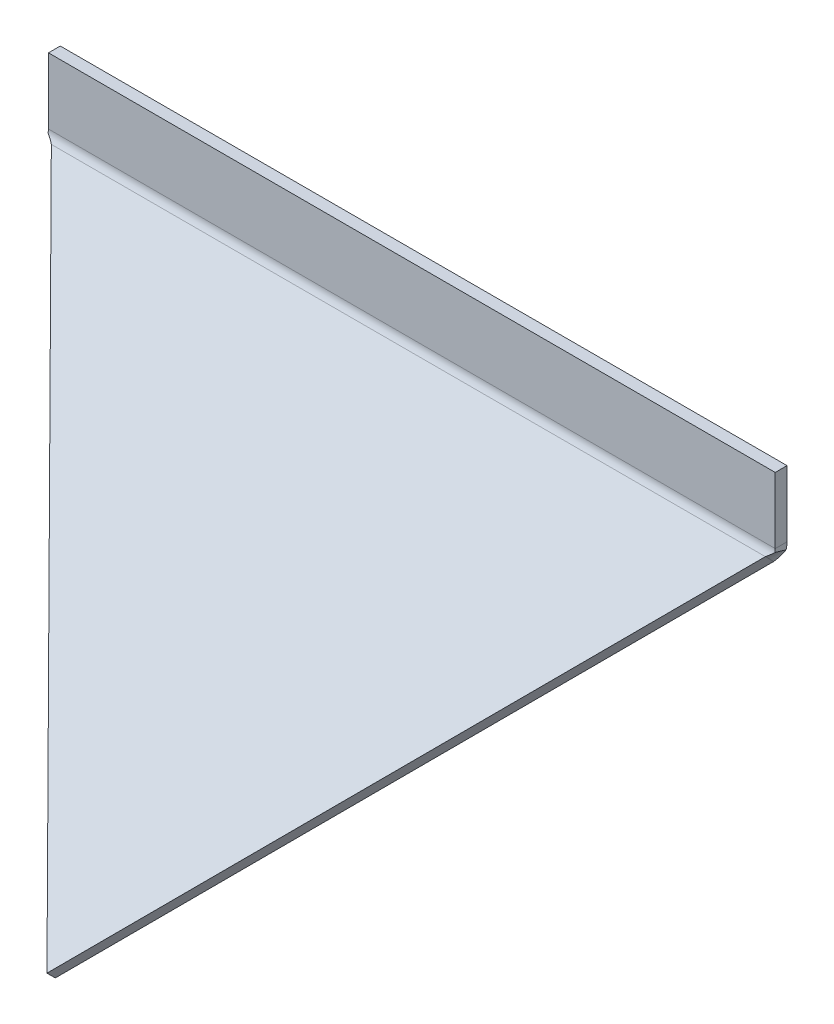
ISO-10303-21;
HEADER;
FILE_DESCRIPTION(('STEP AP214'),'2;1');
FILE_NAME('part.step','',(''),(''),'','','');
FILE_SCHEMA(('AUTOMOTIVE_DESIGN { 1 0 10303 214 1 1 1 1 }'));
ENDSEC;
DATA;
#1=APPLICATION_CONTEXT('core data for automotive mechanical design processes');
#2=APPLICATION_PROTOCOL_DEFINITION('international standard','automotive_design',2000,#1);
#3=PRODUCT_CONTEXT('',#1,'mechanical');
#4=PRODUCT('Part','Part','',(#3));
#5=PRODUCT_RELATED_PRODUCT_CATEGORY('part','',(#4));
#6=PRODUCT_DEFINITION_FORMATION('','',#4);
#7=PRODUCT_DEFINITION_CONTEXT('part definition',#1,'design');
#8=PRODUCT_DEFINITION('design','',#6,#7);
#9=PRODUCT_DEFINITION_SHAPE('','',#8);
#10=(LENGTH_UNIT() NAMED_UNIT(*) SI_UNIT(.MILLI.,.METRE.));
#11=(NAMED_UNIT(*) PLANE_ANGLE_UNIT() SI_UNIT($,.RADIAN.));
#12=(NAMED_UNIT(*) SI_UNIT($,.STERADIAN.) SOLID_ANGLE_UNIT());
#13=UNCERTAINTY_MEASURE_WITH_UNIT(LENGTH_MEASURE(1.E-05),#10,'distance_accuracy_value','');
#14=(GEOMETRIC_REPRESENTATION_CONTEXT(3) GLOBAL_UNCERTAINTY_ASSIGNED_CONTEXT((#13)) GLOBAL_UNIT_ASSIGNED_CONTEXT((#10,
#11,#12)) REPRESENTATION_CONTEXT('',''));
#15=CARTESIAN_POINT('',(0.,0.,0.));
#16=DIRECTION('',(0.,0.,1.));
#17=DIRECTION('',(1.,0.,0.));
#18=AXIS2_PLACEMENT_3D('',#15,#16,#17);
#19=CARTESIAN_POINT('',(0.,0.,0.));
#20=DIRECTION('',(0.,0.,1.));
#21=DIRECTION('',(1.,0.,0.));
#22=AXIS2_PLACEMENT_3D('',#19,#20,#21);
#23=PLANE('',#22);
#24=DIRECTION('',(0.,1.,0.));
#25=VECTOR('',#24,1.);
#26=CARTESIAN_POINT('',(390.5631,556.869599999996,0.));
#27=LINE('',#26,#25);
#28=CARTESIAN_POINT('',(390.5631,562.160001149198,0.));
#29=VERTEX_POINT('',#28);
#30=CARTESIAN_POINT('',(390.5631,633.069599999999,0.));
#31=VERTEX_POINT('',#30);
#32=EDGE_CURVE('E107',#29,#31,#27,.T.);
#33=ORIENTED_EDGE('',*,*,#32,.F.);
#34=DIRECTION('',(-1.,0.,0.));
#35=VECTOR('',#34,1.);
#36=CARTESIAN_POINT('',(2.87641448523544E-12,562.160001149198,0.));
#37=LINE('',#36,#35);
#38=CARTESIAN_POINT('',(-390.5631,562.160001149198,0.));
#39=VERTEX_POINT('',#38);
#40=EDGE_CURVE('E66',#29,#39,#37,.T.);
#41=ORIENTED_EDGE('',*,*,#40,.T.);
#42=DIRECTION('',(0.,-1.,0.));
#43=VECTOR('',#42,1.);
#44=CARTESIAN_POINT('',(-390.5631,633.069599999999,0.));
#45=LINE('',#44,#43);
#46=CARTESIAN_POINT('',(-390.5631,633.069599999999,0.));
#47=VERTEX_POINT('',#46);
#48=EDGE_CURVE('E106',#47,#39,#45,.T.);
#49=ORIENTED_EDGE('',*,*,#48,.F.);
#50=DIRECTION('',(-1.,0.,0.));
#51=VECTOR('',#50,1.);
#52=CARTESIAN_POINT('',(390.5631,633.069599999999,0.));
#53=LINE('',#52,#51);
#54=EDGE_CURVE('E96',#31,#47,#53,.T.);
#55=ORIENTED_EDGE('',*,*,#54,.F.);
#56=EDGE_LOOP('',(#33,#41,#49,#55));
#57=FACE_BOUND('',#56,.T.);
#58=ADVANCED_FACE('F56',(#57),#23,.F.);
#59=CARTESIAN_POINT('',(-390.5631,633.069599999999,12.7));
#60=DIRECTION('',(1.,0.,0.));
#61=DIRECTION('',(0.,0.,-1.));
#62=AXIS2_PLACEMENT_3D('',#59,#60,#61);
#63=PLANE('',#62);
#64=ORIENTED_EDGE('',*,*,#48,.T.);
#65=DIRECTION('',(0.,0.,1.));
#66=VECTOR('',#65,1.);
#67=CARTESIAN_POINT('',(-390.5631,562.1600011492,12.6999999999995));
#68=LINE('',#67,#66);
#69=CARTESIAN_POINT('',(-390.5631,562.160001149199,12.7));
#70=VERTEX_POINT('',#69);
#71=EDGE_CURVE('E400',#39,#70,#68,.T.);
#72=ORIENTED_EDGE('',*,*,#71,.T.);
#73=DIRECTION('',(0.,-1.,0.));
#74=VECTOR('',#73,1.);
#75=CARTESIAN_POINT('',(-390.5631,633.069599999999,12.7));
#76=LINE('',#75,#74);
#77=CARTESIAN_POINT('',(-390.5631,633.069599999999,12.7));
#78=VERTEX_POINT('',#77);
#79=EDGE_CURVE('E115',#78,#70,#76,.T.);
#80=ORIENTED_EDGE('',*,*,#79,.F.);
#81=DIRECTION('',(0.,0.,-1.));
#82=VECTOR('',#81,1.);
#83=CARTESIAN_POINT('',(-390.5631,633.069599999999,12.7));
#84=LINE('',#83,#82);
#85=EDGE_CURVE('E99',#78,#47,#84,.T.);
#86=ORIENTED_EDGE('',*,*,#85,.T.);
#87=EDGE_LOOP('',(#64,#72,#80,#86));
#88=FACE_BOUND('',#87,.T.);
#89=ADVANCED_FACE('F111',(#88),#63,.F.);
#90=CARTESIAN_POINT('',(390.5631,556.869599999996,12.7));
#91=DIRECTION('',(-1.,0.,0.));
#92=DIRECTION('',(0.,0.,1.));
#93=AXIS2_PLACEMENT_3D('',#90,#91,#92);
#94=PLANE('',#93);
#95=DIRECTION('',(0.,1.,0.));
#96=VECTOR('',#95,1.);
#97=CARTESIAN_POINT('',(390.5631,556.869599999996,12.7));
#98=LINE('',#97,#96);
#99=CARTESIAN_POINT('',(390.5631,562.160001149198,12.7));
#100=VERTEX_POINT('',#99);
#101=CARTESIAN_POINT('',(390.5631,633.069599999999,12.7));
#102=VERTEX_POINT('',#101);
#103=EDGE_CURVE('E117',#100,#102,#98,.T.);
#104=ORIENTED_EDGE('',*,*,#103,.F.);
#105=DIRECTION('',(0.,0.,-1.));
#106=VECTOR('',#105,1.);
#107=CARTESIAN_POINT('',(390.5631,562.160001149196,12.7));
#108=LINE('',#107,#106);
#109=EDGE_CURVE('E12',#100,#29,#108,.T.);
#110=ORIENTED_EDGE('',*,*,#109,.T.);
#111=ORIENTED_EDGE('',*,*,#32,.T.);
#112=DIRECTION('',(0.,0.,-1.));
#113=VECTOR('',#112,1.);
#114=CARTESIAN_POINT('',(390.5631,633.069599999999,12.7));
#115=LINE('',#114,#113);
#116=EDGE_CURVE('E102',#102,#31,#115,.T.);
#117=ORIENTED_EDGE('',*,*,#116,.F.);
#118=EDGE_LOOP('',(#104,#110,#111,#117));
#119=FACE_BOUND('',#118,.T.);
#120=ADVANCED_FACE('F416',(#119),#94,.F.);
#121=CARTESIAN_POINT('',(390.5631,633.069599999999,12.7));
#122=DIRECTION('',(0.,-1.,0.));
#123=DIRECTION('',(0.,0.,-1.));
#124=AXIS2_PLACEMENT_3D('',#121,#122,#123);
#125=PLANE('',#124);
#126=ORIENTED_EDGE('',*,*,#54,.T.);
#127=ORIENTED_EDGE('',*,*,#85,.F.);
#128=DIRECTION('',(-1.,0.,0.));
#129=VECTOR('',#128,1.);
#130=CARTESIAN_POINT('',(390.5631,633.069599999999,12.7));
#131=LINE('',#130,#129);
#132=EDGE_CURVE('E83',#102,#78,#131,.T.);
#133=ORIENTED_EDGE('',*,*,#132,.F.);
#134=ORIENTED_EDGE('',*,*,#116,.T.);
#135=EDGE_LOOP('',(#126,#127,#133,#134));
#136=FACE_BOUND('',#135,.T.);
#137=ADVANCED_FACE('F98',(#136),#125,.F.);
#138=CARTESIAN_POINT('',(0.,0.,12.7));
#139=DIRECTION('',(0.,0.,1.));
#140=DIRECTION('',(1.,0.,0.));
#141=AXIS2_PLACEMENT_3D('',#138,#139,#140);
#142=PLANE('',#141);
#143=DIRECTION('',(-1.,0.,0.));
#144=VECTOR('',#143,1.);
#145=CARTESIAN_POINT('',(2.87641448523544E-12,562.160001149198,12.7));
#146=LINE('',#145,#144);
#147=EDGE_CURVE('E399',#100,#70,#146,.T.);
#148=ORIENTED_EDGE('',*,*,#147,.F.);
#149=ORIENTED_EDGE('',*,*,#103,.T.);
#150=ORIENTED_EDGE('',*,*,#132,.T.);
#151=ORIENTED_EDGE('',*,*,#79,.T.);
#152=EDGE_LOOP('',(#148,#149,#150,#151));
#153=FACE_BOUND('',#152,.T.);
#154=ADVANCED_FACE('F401',(#153),#142,.T.);
#155=CARTESIAN_POINT('',(383.726360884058,544.12753569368,7.51173039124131));
#156=CARTESIAN_POINT('',(386.00811719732,547.182491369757,4.43214897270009));
#157=CARTESIAN_POINT('',(388.281343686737,551.024847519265,2.16242418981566));
#158=CARTESIAN_POINT('',(390.5631,555.196453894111,0.973190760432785));
#159=CARTESIAN_POINT('',(383.726360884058,553.143768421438,16.4558651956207));
#160=CARTESIAN_POINT('',(386.007170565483,554.670612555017,14.9167132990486));
#161=CARTESIAN_POINT('',(388.282290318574,556.593289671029,13.7809654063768));
#162=CARTESIAN_POINT('',(390.5631,558.678227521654,13.1865953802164));
#163=B_SPLINE_SURFACE_WITH_KNOTS('',1,3,((#155,#156,#157,#158),(#159,#160,#161,#162)),
.UNSPECIFIED.,.F.,.F.,.F.,(2,2),(4,4),(0.,1.),(0.,1.),.UNSPECIFIED.);
#164=CARTESIAN_POINT('',(383.726360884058,553.143768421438,16.4558651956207));
#165=CARTESIAN_POINT('',(383.726360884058,544.12753569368,7.51173039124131));
#166=B_SPLINE_CURVE_WITH_KNOTS('',1,(#164,#165),.UNSPECIFIED.,.F.,.F.,(2,2),(0.,1.),.UNSPECIFIED.);
#167=CARTESIAN_POINT('',(383.726360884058,553.143768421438,16.4558651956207));
#168=VERTEX_POINT('',#167);
#169=CARTESIAN_POINT('',(383.726360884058,544.12753569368,7.51173039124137));
#170=VERTEX_POINT('',#169);
#171=EDGE_CURVE('E317',#168,#170,#166,.T.);
#172=CARTESIAN_POINT('',(383.726360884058,544.12753569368,7.51173039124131));
#173=CARTESIAN_POINT('',(386.00811719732,547.182491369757,4.43214897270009));
#174=CARTESIAN_POINT('',(388.281343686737,551.024847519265,2.16242418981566));
#175=CARTESIAN_POINT('',(390.5631,555.196453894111,0.973190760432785));
#176=B_SPLINE_CURVE_WITH_KNOTS('',3,(#172,#173,#174,#175),.UNSPECIFIED.,.F.,.F.,(4,4),(0.,1.),.UNSPECIFIED.);
#177=CARTESIAN_POINT('',(390.5631,555.196453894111,0.973190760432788));
#178=VERTEX_POINT('',#177);
#179=EDGE_CURVE('E328',#170,#178,#176,.T.);
#180=CARTESIAN_POINT('',(390.5631,555.196453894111,0.973190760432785));
#181=CARTESIAN_POINT('',(390.5631,558.678227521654,13.1865953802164));
#182=B_SPLINE_CURVE_WITH_KNOTS('',1,(#180,#181),.UNSPECIFIED.,.F.,.F.,(2,2),(0.,1.),.UNSPECIFIED.);
#183=CARTESIAN_POINT('',(390.5631,558.678227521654,13.1865953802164));
#184=VERTEX_POINT('',#183);
#185=EDGE_CURVE('E383',#178,#184,#182,.T.);
#186=CARTESIAN_POINT('',(390.5631,558.678227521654,13.1865953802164));
#187=CARTESIAN_POINT('',(388.282290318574,556.593289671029,13.7809654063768));
#188=CARTESIAN_POINT('',(386.007170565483,554.670612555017,14.9167132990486));
#189=CARTESIAN_POINT('',(383.726360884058,553.143768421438,16.4558651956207));
#190=B_SPLINE_CURVE_WITH_KNOTS('',3,(#186,#187,#188,#189),.UNSPECIFIED.,.F.,.F.,(4,4),(0.,1.),.UNSPECIFIED.);
#191=EDGE_CURVE('E331',#168,#184,#190,.F.);
#192=ORIENTED_EDGE('',*,*,#171,.T.);
#193=ORIENTED_EDGE('',*,*,#179,.T.);
#194=ORIENTED_EDGE('',*,*,#185,.T.);
#195=ORIENTED_EDGE('',*,*,#191,.F.);
#196=EDGE_LOOP('',(#192,#193,#194,#195));
#197=FACE_BOUND('',#196,.T.);
#198=ADVANCED_FACE('F253',(#197),#163,.F.);
#199=CARTESIAN_POINT('',(390.5631,562.160001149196,25.4));
#200=DIRECTION('',(-1.,0.,0.));
#201=DIRECTION('',(0.,0.,1.));
#202=AXIS2_PLACEMENT_3D('',#199,#200,#201);
#203=PLANE('',#202);
#204=ORIENTED_EDGE('',*,*,#185,.F.);
#205=CARTESIAN_POINT('',(390.5631,562.160001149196,25.4));
#206=DIRECTION('',(1.,0.,0.));
#207=DIRECTION('',(0.,1.,0.));
#208=AXIS2_PLACEMENT_3D('',#205,#206,#207);
#209=CIRCLE('',#208,25.4);
#210=EDGE_CURVE('E74',#178,#29,#209,.T.);
#211=ORIENTED_EDGE('',*,*,#210,.T.);
#212=ORIENTED_EDGE('',*,*,#109,.F.);
#213=CARTESIAN_POINT('',(390.5631,562.160001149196,25.4));
#214=DIRECTION('',(1.,0.,0.));
#215=DIRECTION('',(0.,0.,-1.));
#216=AXIS2_PLACEMENT_3D('',#213,#214,#215);
#217=CIRCLE('',#216,12.7);
#218=EDGE_CURVE('E212',#184,#100,#217,.T.);
#219=ORIENTED_EDGE('',*,*,#218,.F.);
#220=EDGE_LOOP('',(#204,#211,#212,#219));
#221=FACE_BOUND('',#220,.T.);
#222=ADVANCED_FACE('F297',(#221),#203,.F.);
#223=CARTESIAN_POINT('',(-390.5631,562.1600011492,25.4));
#224=DIRECTION('',(1.,0.,0.));
#225=DIRECTION('',(0.,0.,-1.));
#226=AXIS2_PLACEMENT_3D('',#223,#224,#225);
#227=PLANE('',#226);
#228=ORIENTED_EDGE('',*,*,#71,.F.);
#229=CARTESIAN_POINT('',(-390.5631,562.1600011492,25.4));
#230=DIRECTION('',(1.,0.,0.));
#231=DIRECTION('',(0.,1.,0.));
#232=AXIS2_PLACEMENT_3D('',#229,#230,#231);
#233=CIRCLE('',#232,25.4);
#234=CARTESIAN_POINT('',(-390.5631,555.196453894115,0.973190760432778));
#235=VERTEX_POINT('',#234);
#236=EDGE_CURVE('E225',#39,#235,#233,.F.);
#237=ORIENTED_EDGE('',*,*,#236,.T.);
#238=CARTESIAN_POINT('',(-390.5631,558.678227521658,13.1865953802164));
#239=CARTESIAN_POINT('',(-390.5631,555.196453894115,0.973190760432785));
#240=B_SPLINE_CURVE_WITH_KNOTS('',1,(#238,#239),.UNSPECIFIED.,.F.,.F.,(2,2),(0.,1.),.UNSPECIFIED.);
#241=CARTESIAN_POINT('',(-390.5631,558.678227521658,13.1865953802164));
#242=VERTEX_POINT('',#241);
#243=EDGE_CURVE('E286',#235,#242,#240,.F.);
#244=ORIENTED_EDGE('',*,*,#243,.T.);
#245=CARTESIAN_POINT('',(-390.5631,562.1600011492,25.4));
#246=DIRECTION('',(-1.,0.,0.));
#247=DIRECTION('',(0.,0.,1.));
#248=AXIS2_PLACEMENT_3D('',#245,#246,#247);
#249=CIRCLE('',#248,12.7);
#250=EDGE_CURVE('E210',#70,#242,#249,.T.);
#251=ORIENTED_EDGE('',*,*,#250,.F.);
#252=EDGE_LOOP('',(#228,#237,#244,#251));
#253=FACE_BOUND('',#252,.T.);
#254=ADVANCED_FACE('F180',(#253),#227,.F.);
#255=CARTESIAN_POINT('',(-390.5631,555.196453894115,0.973190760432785));
#256=CARTESIAN_POINT('',(-388.281343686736,551.024847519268,2.16242418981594));
#257=CARTESIAN_POINT('',(-386.00811719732,547.182491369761,4.43214897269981));
#258=CARTESIAN_POINT('',(-383.726360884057,544.127535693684,7.5117303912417));
#259=CARTESIAN_POINT('',(-390.5631,558.678227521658,13.1865953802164));
#260=CARTESIAN_POINT('',(-388.282290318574,556.593289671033,13.7809654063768));
#261=CARTESIAN_POINT('',(-386.007170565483,554.670612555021,14.9167132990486));
#262=CARTESIAN_POINT('',(-383.726360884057,553.143768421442,16.4558651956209));
#263=B_SPLINE_SURFACE_WITH_KNOTS('',1,3,((#255,#256,#257,#258),(#259,#260,#261,#262)),
.UNSPECIFIED.,.F.,.F.,.F.,(2,2),(4,4),(0.,1.),(0.,1.),.UNSPECIFIED.);
#264=CARTESIAN_POINT('',(-390.5631,555.196453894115,0.973190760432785));
#265=CARTESIAN_POINT('',(-388.281343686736,551.024847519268,2.16242418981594));
#266=CARTESIAN_POINT('',(-386.00811719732,547.182491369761,4.43214897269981));
#267=CARTESIAN_POINT('',(-383.726360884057,544.127535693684,7.5117303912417));
#268=B_SPLINE_CURVE_WITH_KNOTS('',3,(#264,#265,#266,#267),.UNSPECIFIED.,.F.,.F.,(4,4),(0.,1.),.UNSPECIFIED.);
#269=CARTESIAN_POINT('',(-383.726360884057,544.127535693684,7.51173039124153));
#270=VERTEX_POINT('',#269);
#271=EDGE_CURVE('E221',#235,#270,#268,.T.);
#272=CARTESIAN_POINT('',(-383.726360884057,544.127535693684,7.5117303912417));
#273=CARTESIAN_POINT('',(-383.726360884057,553.143768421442,16.4558651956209));
#274=B_SPLINE_CURVE_WITH_KNOTS('',1,(#272,#273),.UNSPECIFIED.,.F.,.F.,(2,2),(0.,1.),.UNSPECIFIED.);
#275=CARTESIAN_POINT('',(-383.726360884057,553.143768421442,16.4558651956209));
#276=VERTEX_POINT('',#275);
#277=EDGE_CURVE('E127',#270,#276,#274,.T.);
#278=CARTESIAN_POINT('',(-383.726360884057,553.143768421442,16.4558651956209));
#279=CARTESIAN_POINT('',(-386.007170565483,554.670612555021,14.9167132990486));
#280=CARTESIAN_POINT('',(-388.282290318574,556.593289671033,13.7809654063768));
#281=CARTESIAN_POINT('',(-390.5631,558.678227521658,13.1865953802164));
#282=B_SPLINE_CURVE_WITH_KNOTS('',3,(#278,#279,#280,#281),.UNSPECIFIED.,.F.,.F.,(4,4),(0.,1.),.UNSPECIFIED.);
#283=EDGE_CURVE('E209',#242,#276,#282,.F.);
#284=ORIENTED_EDGE('',*,*,#271,.T.);
#285=ORIENTED_EDGE('',*,*,#277,.T.);
#286=ORIENTED_EDGE('',*,*,#283,.F.);
#287=ORIENTED_EDGE('',*,*,#243,.F.);
#288=EDGE_LOOP('',(#284,#285,#286,#287));
#289=FACE_BOUND('',#288,.T.);
#290=ADVANCED_FACE('F178',(#289),#263,.F.);
#291=CARTESIAN_POINT('',(-781.374161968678,562.160001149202,25.4));
#292=DIRECTION('',(1.,0.,0.));
#293=DIRECTION('',(0.,1.,0.));
#294=AXIS2_PLACEMENT_3D('',#291,#292,#293);
#295=CYLINDRICAL_SURFACE('',#294,12.7);
#296=ORIENTED_EDGE('',*,*,#250,.T.);
#297=ORIENTED_EDGE('',*,*,#283,.T.);
#298=DIRECTION('',(-1.,0.,0.));
#299=VECTOR('',#298,1.);
#300=CARTESIAN_POINT('',(2.68643034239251E-12,553.14376842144,16.4558651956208));
#301=LINE('',#300,#299);
#302=EDGE_CURVE('E126',#168,#276,#301,.T.);
#303=ORIENTED_EDGE('',*,*,#302,.F.);
#304=ORIENTED_EDGE('',*,*,#191,.T.);
#305=ORIENTED_EDGE('',*,*,#218,.T.);
#306=ORIENTED_EDGE('',*,*,#147,.T.);
#307=EDGE_LOOP('',(#296,#297,#303,#304,#305,#306));
#308=FACE_BOUND('',#307,.T.);
#309=ADVANCED_FACE('F173',(#308),#295,.F.);
#310=CARTESIAN_POINT('',(-781.374161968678,562.160001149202,25.4));
#311=DIRECTION('',(1.,0.,0.));
#312=DIRECTION('',(0.,1.,0.));
#313=AXIS2_PLACEMENT_3D('',#310,#311,#312);
#314=CYLINDRICAL_SURFACE('',#313,25.4);
#315=ORIENTED_EDGE('',*,*,#236,.F.);
#316=ORIENTED_EDGE('',*,*,#40,.F.);
#317=ORIENTED_EDGE('',*,*,#210,.F.);
#318=ORIENTED_EDGE('',*,*,#179,.F.);
#319=DIRECTION('',(-1.,0.,0.));
#320=VECTOR('',#319,1.);
#321=CARTESIAN_POINT('',(2.64029681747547E-12,544.127535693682,7.51173039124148));
#322=LINE('',#321,#320);
#323=EDGE_CURVE('E152',#170,#270,#322,.T.);
#324=ORIENTED_EDGE('',*,*,#323,.T.);
#325=ORIENTED_EDGE('',*,*,#271,.F.);
#326=EDGE_LOOP('',(#315,#316,#317,#318,#324,#325));
#327=FACE_BOUND('',#326,.T.);
#328=ADVANCED_FACE('F177',(#327),#314,.T.);
#329=CARTESIAN_POINT('',(8.23289642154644E-13,167.826430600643,404.879213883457));
#330=DIRECTION('',(0.,0.709939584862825,0.704262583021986));
#331=DIRECTION('',(1.,0.,0.));
#332=AXIS2_PLACEMENT_3D('',#329,#330,#331);
#333=PLANE('',#332);
#334=DIRECTION('',(0.574206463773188,0.576587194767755,-0.581235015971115));
#335=VECTOR('',#334,1.);
#336=CARTESIAN_POINT('',(8.23289642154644E-13,167.826430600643,404.879213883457));
#337=LINE('',#336,#335);
#338=CARTESIAN_POINT('',(8.23289642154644E-13,167.826430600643,404.879213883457));
#339=VERTEX_POINT('',#338);
#340=EDGE_CURVE('E123',#339,#168,#337,.T.);
#341=ORIENTED_EDGE('',*,*,#340,.T.);
#342=ORIENTED_EDGE('',*,*,#302,.T.);
#343=DIRECTION('',(0.574206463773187,-0.576587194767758,0.581235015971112));
#344=VECTOR('',#343,1.);
#345=CARTESIAN_POINT('',(8.23289642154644E-13,167.826430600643,404.879213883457));
#346=LINE('',#345,#344);
#347=EDGE_CURVE('E132',#276,#339,#346,.T.);
#348=ORIENTED_EDGE('',*,*,#347,.T.);
#349=EDGE_LOOP('',(#341,#342,#348));
#350=FACE_BOUND('',#349,.T.);
#351=ADVANCED_FACE('F165',(#350),#333,.T.);
#352=CARTESIAN_POINT('',(8.23289642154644E-13,167.826430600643,404.879213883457));
#353=DIRECTION('',(0.818710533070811,0.404392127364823,-0.407651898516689));
#354=DIRECTION('',(-0.574206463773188,0.576587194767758,-0.581235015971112));
#355=AXIS2_PLACEMENT_3D('',#352,#353,#354);
#356=PLANE('',#355);
#357=ORIENTED_EDGE('',*,*,#277,.F.);
#358=DIRECTION('',(0.574206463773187,-0.576587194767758,0.581235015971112));
#359=VECTOR('',#358,1.);
#360=CARTESIAN_POINT('',(7.7715611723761E-13,158.810197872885,395.935079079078));
#361=LINE('',#360,#359);
#362=CARTESIAN_POINT('',(7.7715611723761E-13,158.810197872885,395.935079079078));
#363=VERTEX_POINT('',#362);
#364=EDGE_CURVE('E137',#270,#363,#361,.T.);
#365=ORIENTED_EDGE('',*,*,#364,.T.);
#366=DIRECTION('',(0.,-0.709939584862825,-0.704262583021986));
#367=VECTOR('',#366,1.);
#368=CARTESIAN_POINT('',(8.23289642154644E-13,167.826430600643,404.879213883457));
#369=LINE('',#368,#367);
#370=EDGE_CURVE('E388',#339,#363,#369,.T.);
#371=ORIENTED_EDGE('',*,*,#370,.F.);
#372=ORIENTED_EDGE('',*,*,#347,.F.);
#373=EDGE_LOOP('',(#357,#365,#371,#372));
#374=FACE_BOUND('',#373,.T.);
#375=ADVANCED_FACE('F154',(#374),#356,.F.);
#376=CARTESIAN_POINT('',(7.7715611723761E-13,158.810197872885,395.935079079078));
#377=DIRECTION('',(0.,0.709939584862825,0.704262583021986));
#378=DIRECTION('',(1.,0.,0.));
#379=AXIS2_PLACEMENT_3D('',#376,#377,#378);
#380=PLANE('',#379);
#381=ORIENTED_EDGE('',*,*,#323,.F.);
#382=DIRECTION('',(0.574206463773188,0.576587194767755,-0.581235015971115));
#383=VECTOR('',#382,1.);
#384=CARTESIAN_POINT('',(7.7715611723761E-13,158.810197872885,395.935079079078));
#385=LINE('',#384,#383);
#386=EDGE_CURVE('E338',#363,#170,#385,.T.);
#387=ORIENTED_EDGE('',*,*,#386,.F.);
#388=ORIENTED_EDGE('',*,*,#364,.F.);
#389=EDGE_LOOP('',(#381,#387,#388));
#390=FACE_BOUND('',#389,.T.);
#391=ADVANCED_FACE('F164',(#390),#380,.F.);
#392=CARTESIAN_POINT('',(8.23289642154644E-13,167.826430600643,404.879213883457));
#393=DIRECTION('',(-0.818710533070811,0.404392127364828,-0.407651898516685));
#394=DIRECTION('',(-0.574206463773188,-0.576587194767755,0.581235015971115));
#395=AXIS2_PLACEMENT_3D('',#392,#393,#394);
#396=PLANE('',#395);
#397=ORIENTED_EDGE('',*,*,#171,.F.);
#398=ORIENTED_EDGE('',*,*,#340,.F.);
#399=ORIENTED_EDGE('',*,*,#370,.T.);
#400=ORIENTED_EDGE('',*,*,#386,.T.);
#401=EDGE_LOOP('',(#397,#398,#399,#400));
#402=FACE_BOUND('',#401,.T.);
#403=ADVANCED_FACE('F167',(#402),#396,.F.);
#404=CLOSED_SHELL('',(#58,#89,#120,#137,#154,#198,#222,#254,#290,#309,#328,#351,#375,#391,#403));
#405=MANIFOLD_SOLID_BREP('B2',#404);
#406=ADVANCED_BREP_SHAPE_REPRESENTATION('',(#18,#405),#14);
#407=SHAPE_DEFINITION_REPRESENTATION(#9,#406);
ENDSEC;
END-ISO-10303-21;
